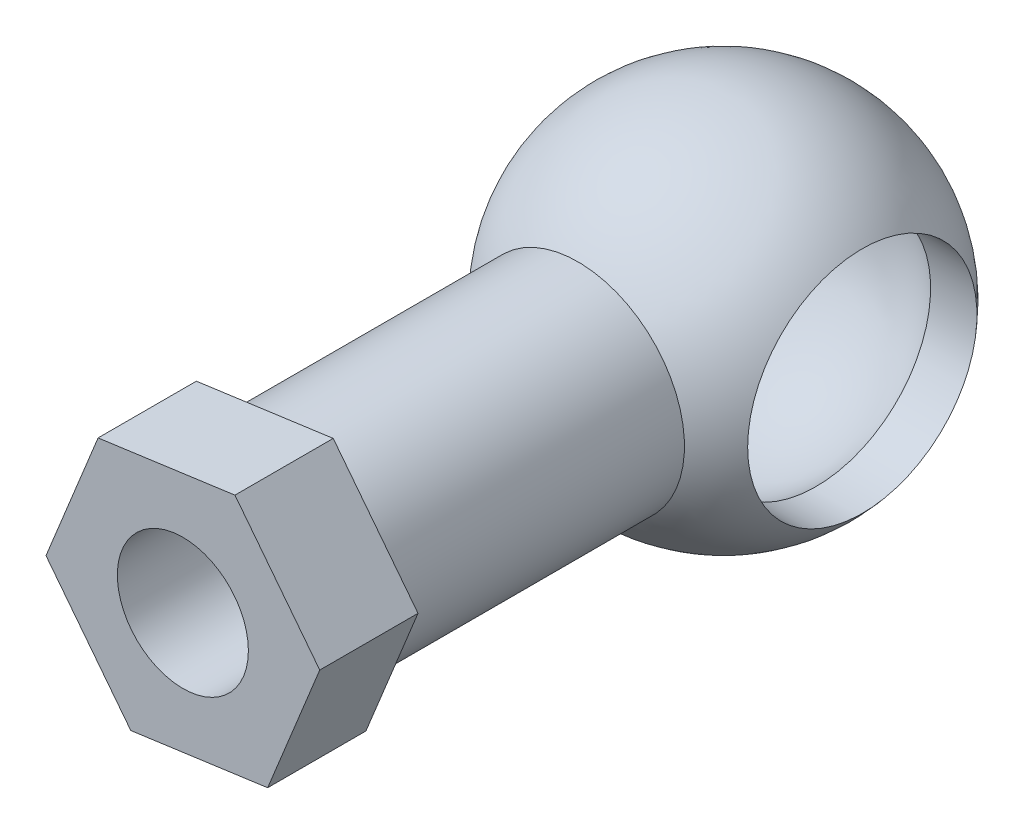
ISO-10303-21;
HEADER;
FILE_DESCRIPTION(('STEP AP214'),'2;1');
FILE_NAME('part.step','',(''),(''),'','','');
FILE_SCHEMA(('AUTOMOTIVE_DESIGN { 1 0 10303 214 1 1 1 1 }'));
ENDSEC;
DATA;
#1=APPLICATION_CONTEXT('core data for automotive mechanical design processes');
#2=APPLICATION_PROTOCOL_DEFINITION('international standard','automotive_design',2000,#1);
#3=PRODUCT_CONTEXT('',#1,'mechanical');
#4=PRODUCT('Part','Part','',(#3));
#5=PRODUCT_RELATED_PRODUCT_CATEGORY('part','',(#4));
#6=PRODUCT_DEFINITION_FORMATION('','',#4);
#7=PRODUCT_DEFINITION_CONTEXT('part definition',#1,'design');
#8=PRODUCT_DEFINITION('design','',#6,#7);
#9=PRODUCT_DEFINITION_SHAPE('','',#8);
#10=(LENGTH_UNIT() NAMED_UNIT(*) SI_UNIT(.MILLI.,.METRE.));
#11=(NAMED_UNIT(*) PLANE_ANGLE_UNIT() SI_UNIT($,.RADIAN.));
#12=(NAMED_UNIT(*) SI_UNIT($,.STERADIAN.) SOLID_ANGLE_UNIT());
#13=UNCERTAINTY_MEASURE_WITH_UNIT(LENGTH_MEASURE(1.E-05),#10,'distance_accuracy_value','');
#14=(GEOMETRIC_REPRESENTATION_CONTEXT(3) GLOBAL_UNCERTAINTY_ASSIGNED_CONTEXT((#13)) GLOBAL_UNIT_ASSIGNED_CONTEXT((#10,
#11,#12)) REPRESENTATION_CONTEXT('',''));
#15=CARTESIAN_POINT('',(0.,0.,0.));
#16=DIRECTION('',(0.,0.,1.));
#17=DIRECTION('',(1.,0.,0.));
#18=AXIS2_PLACEMENT_3D('',#15,#16,#17);
#19=CARTESIAN_POINT('',(0.,0.,0.));
#20=DIRECTION('',(0.,1.,0.));
#21=DIRECTION('',(-1.,0.,0.));
#22=AXIS2_PLACEMENT_3D('',#19,#20,#21);
#23=SPHERICAL_SURFACE('',#22,9.);
#24=CARTESIAN_POINT('',(0.,0.,0.));
#25=DIRECTION('',(-1.,0.,0.));
#26=DIRECTION('',(0.,0.,1.));
#27=AXIS2_PLACEMENT_3D('',#24,#25,#26);
#28=SPHERICAL_SURFACE('',#27,9.);
#29=CARTESIAN_POINT('',(5.65685424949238,0.,0.));
#30=DIRECTION('',(-1.,0.,0.));
#31=DIRECTION('',(0.,0.,1.));
#32=AXIS2_PLACEMENT_3D('',#29,#30,#31);
#33=CIRCLE('',#32,7.);
#34=CARTESIAN_POINT('',(5.65685424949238,0.,7.));
#35=VERTEX_POINT('',#34);
#36=EDGE_CURVE('E142',#35,#35,#33,.F.);
#37=ORIENTED_EDGE('',*,*,#36,.T.);
#38=EDGE_LOOP('',(#37));
#39=FACE_BOUND('',#38,.T.);
#40=ADVANCED_FACE('F33',(#39),#28,.F.);
#41=CARTESIAN_POINT('',(30.,0.,0.));
#42=DIRECTION('',(-1.,0.,0.));
#43=DIRECTION('',(0.,0.,1.));
#44=AXIS2_PLACEMENT_3D('',#41,#42,#43);
#45=CYLINDRICAL_SURFACE('',#44,7.);
#46=CARTESIAN_POINT('',(8.48528137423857,0.,0.));
#47=DIRECTION('',(-1.,0.,0.));
#48=DIRECTION('',(0.,0.,1.));
#49=AXIS2_PLACEMENT_3D('',#46,#47,#48);
#50=CIRCLE('',#49,7.);
#51=CARTESIAN_POINT('',(8.48528137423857,0.,7.));
#52=VERTEX_POINT('',#51);
#53=EDGE_CURVE('E143',#52,#52,#50,.T.);
#54=ORIENTED_EDGE('',*,*,#53,.F.);
#55=EDGE_LOOP('',(#54));
#56=FACE_BOUND('',#55,.T.);
#57=ORIENTED_EDGE('',*,*,#36,.F.);
#58=EDGE_LOOP('',(#57));
#59=FACE_BOUND('',#58,.T.);
#60=ADVANCED_FACE('F155',(#56,#59),#45,.F.);
#61=CARTESIAN_POINT('',(0.,0.,0.));
#62=DIRECTION('',(0.,1.,0.));
#63=DIRECTION('',(1.,0.,0.));
#64=AXIS2_PLACEMENT_3D('',#61,#62,#63);
#65=SPHERICAL_SURFACE('',#64,11.);
#66=CARTESIAN_POINT('',(0.,0.,8.87411967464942));
#67=DIRECTION('',(0.,0.,-1.));
#68=DIRECTION('',(-1.,0.,0.));
#69=AXIS2_PLACEMENT_3D('',#66,#67,#68);
#70=CIRCLE('',#69,6.5);
#71=CARTESIAN_POINT('',(-6.5,0.,8.87411967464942));
#72=VERTEX_POINT('',#71);
#73=EDGE_CURVE('E41',#72,#72,#70,.F.);
#74=ORIENTED_EDGE('',*,*,#73,.F.);
#75=EDGE_LOOP('',(#74));
#76=FACE_BOUND('',#75,.T.);
#77=ORIENTED_EDGE('',*,*,#53,.T.);
#78=EDGE_LOOP('',(#77));
#79=FACE_BOUND('',#78,.T.);
#80=ADVANCED_FACE('F152',(#76,#79),#65,.T.);
#81=CARTESIAN_POINT('',(0.,0.,0.));
#82=DIRECTION('',(0.,0.,-1.));
#83=DIRECTION('',(-1.,0.,0.));
#84=AXIS2_PLACEMENT_3D('',#81,#82,#83);
#85=CYLINDRICAL_SURFACE('',#84,6.5);
#86=CARTESIAN_POINT('',(0.,0.,27.));
#87=DIRECTION('',(0.,0.,1.));
#88=DIRECTION('',(1.,0.,0.));
#89=AXIS2_PLACEMENT_3D('',#86,#87,#88);
#90=CIRCLE('',#89,6.5);
#91=CARTESIAN_POINT('',(6.5,0.,27.));
#92=VERTEX_POINT('',#91);
#93=EDGE_CURVE('E139',#92,#92,#90,.F.);
#94=ORIENTED_EDGE('',*,*,#93,.T.);
#95=EDGE_LOOP('',(#94));
#96=FACE_BOUND('',#95,.T.);
#97=ORIENTED_EDGE('',*,*,#73,.T.);
#98=EDGE_LOOP('',(#97));
#99=FACE_BOUND('',#98,.T.);
#100=ADVANCED_FACE('F150',(#96,#99),#85,.T.);
#101=CARTESIAN_POINT('',(5.1770491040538,-6.66122630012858,33.));
#102=DIRECTION('',(0.,0.,1.));
#103=DIRECTION('',(1.,0.,0.));
#104=AXIS2_PLACEMENT_3D('',#101,#102,#103);
#105=PLANE('',#104);
#106=DIRECTION('',(0.990619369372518,0.136650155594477,0.));
#107=VECTOR('',#106,1.);
#108=CARTESIAN_POINT('',(-3.18026664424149,-7.81406919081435,33.));
#109=LINE('',#108,#107);
#110=CARTESIAN_POINT('',(-3.18026664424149,-7.81406919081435,33.));
#111=VERTEX_POINT('',#110);
#112=CARTESIAN_POINT('',(5.1770491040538,-6.66122630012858,33.));
#113=VERTEX_POINT('',#112);
#114=EDGE_CURVE('E130',#111,#113,#109,.T.);
#115=ORIENTED_EDGE('',*,*,#114,.T.);
#116=DIRECTION('',(0.376967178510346,0.926226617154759,0.));
#117=VECTOR('',#116,1.);
#118=CARTESIAN_POINT('',(5.1770491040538,-6.66122630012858,33.));
#119=LINE('',#118,#117);
#120=CARTESIAN_POINT('',(8.35731574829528,1.15284289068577,33.));
#121=VERTEX_POINT('',#120);
#122=EDGE_CURVE('E87',#113,#121,#119,.T.);
#123=ORIENTED_EDGE('',*,*,#122,.T.);
#124=DIRECTION('',(-0.613652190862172,0.789576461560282,0.));
#125=VECTOR('',#124,1.);
#126=CARTESIAN_POINT('',(8.35731574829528,1.15284289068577,33.));
#127=LINE('',#126,#125);
#128=CARTESIAN_POINT('',(3.18026664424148,7.81406919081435,33.));
#129=VERTEX_POINT('',#128);
#130=EDGE_CURVE('E101',#121,#129,#127,.T.);
#131=ORIENTED_EDGE('',*,*,#130,.T.);
#132=DIRECTION('',(-0.990619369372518,-0.136650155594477,0.));
#133=VECTOR('',#132,1.);
#134=CARTESIAN_POINT('',(3.18026664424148,7.81406919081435,33.));
#135=LINE('',#134,#133);
#136=CARTESIAN_POINT('',(-5.1770491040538,6.66122630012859,33.));
#137=VERTEX_POINT('',#136);
#138=EDGE_CURVE('E94',#129,#137,#135,.T.);
#139=ORIENTED_EDGE('',*,*,#138,.T.);
#140=DIRECTION('',(-0.376967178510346,-0.926226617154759,0.));
#141=VECTOR('',#140,1.);
#142=CARTESIAN_POINT('',(-5.1770491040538,6.66122630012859,33.));
#143=LINE('',#142,#141);
#144=CARTESIAN_POINT('',(-8.35731574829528,-1.15284289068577,33.));
#145=VERTEX_POINT('',#144);
#146=EDGE_CURVE('E99',#137,#145,#143,.T.);
#147=ORIENTED_EDGE('',*,*,#146,.T.);
#148=DIRECTION('',(0.613652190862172,-0.789576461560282,0.));
#149=VECTOR('',#148,1.);
#150=CARTESIAN_POINT('',(-8.35731574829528,-1.15284289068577,33.));
#151=LINE('',#150,#149);
#152=EDGE_CURVE('E49',#145,#111,#151,.T.);
#153=ORIENTED_EDGE('',*,*,#152,.T.);
#154=EDGE_LOOP('',(#115,#123,#131,#139,#147,#153));
#155=FACE_BOUND('',#154,.T.);
#156=CARTESIAN_POINT('',(0.,0.,33.));
#157=DIRECTION('',(0.,0.,1.));
#158=DIRECTION('',(1.,0.,0.));
#159=AXIS2_PLACEMENT_3D('',#156,#157,#158);
#160=CIRCLE('',#159,4.);
#161=CARTESIAN_POINT('',(4.,0.,33.));
#162=VERTEX_POINT('',#161);
#163=EDGE_CURVE('E123',#162,#162,#160,.T.);
#164=ORIENTED_EDGE('',*,*,#163,.F.);
#165=EDGE_LOOP('',(#164));
#166=FACE_BOUND('',#165,.T.);
#167=ADVANCED_FACE('F96',(#155,#166),#105,.T.);
#168=CARTESIAN_POINT('',(5.1770491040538,-6.66122630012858,27.));
#169=DIRECTION('',(0.,0.,1.));
#170=DIRECTION('',(1.,0.,0.));
#171=AXIS2_PLACEMENT_3D('',#168,#169,#170);
#172=PLANE('',#171);
#173=ORIENTED_EDGE('',*,*,#93,.F.);
#174=EDGE_LOOP('',(#173));
#175=FACE_BOUND('',#174,.T.);
#176=DIRECTION('',(0.990619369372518,0.136650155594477,0.));
#177=VECTOR('',#176,1.);
#178=CARTESIAN_POINT('',(-3.18026664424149,-7.81406919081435,27.));
#179=LINE('',#178,#177);
#180=CARTESIAN_POINT('',(-3.18026664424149,-7.81406919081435,27.));
#181=VERTEX_POINT('',#180);
#182=CARTESIAN_POINT('',(5.1770491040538,-6.66122630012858,27.));
#183=VERTEX_POINT('',#182);
#184=EDGE_CURVE('E119',#181,#183,#179,.T.);
#185=ORIENTED_EDGE('',*,*,#184,.F.);
#186=DIRECTION('',(0.613652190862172,-0.789576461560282,0.));
#187=VECTOR('',#186,1.);
#188=CARTESIAN_POINT('',(-8.35731574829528,-1.15284289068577,27.));
#189=LINE('',#188,#187);
#190=CARTESIAN_POINT('',(-8.35731574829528,-1.15284289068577,27.));
#191=VERTEX_POINT('',#190);
#192=EDGE_CURVE('E78',#191,#181,#189,.T.);
#193=ORIENTED_EDGE('',*,*,#192,.F.);
#194=DIRECTION('',(-0.376967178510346,-0.926226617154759,0.));
#195=VECTOR('',#194,1.);
#196=CARTESIAN_POINT('',(-5.1770491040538,6.66122630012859,27.));
#197=LINE('',#196,#195);
#198=CARTESIAN_POINT('',(-5.1770491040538,6.66122630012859,27.));
#199=VERTEX_POINT('',#198);
#200=EDGE_CURVE('E72',#199,#191,#197,.T.);
#201=ORIENTED_EDGE('',*,*,#200,.F.);
#202=DIRECTION('',(-0.990619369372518,-0.136650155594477,0.));
#203=VECTOR('',#202,1.);
#204=CARTESIAN_POINT('',(3.18026664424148,7.81406919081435,27.));
#205=LINE('',#204,#203);
#206=CARTESIAN_POINT('',(3.18026664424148,7.81406919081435,27.));
#207=VERTEX_POINT('',#206);
#208=EDGE_CURVE('E109',#207,#199,#205,.T.);
#209=ORIENTED_EDGE('',*,*,#208,.F.);
#210=DIRECTION('',(-0.613652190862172,0.789576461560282,0.));
#211=VECTOR('',#210,1.);
#212=CARTESIAN_POINT('',(8.35731574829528,1.15284289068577,27.));
#213=LINE('',#212,#211);
#214=CARTESIAN_POINT('',(8.35731574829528,1.15284289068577,27.));
#215=VERTEX_POINT('',#214);
#216=EDGE_CURVE('E125',#215,#207,#213,.T.);
#217=ORIENTED_EDGE('',*,*,#216,.F.);
#218=DIRECTION('',(0.376967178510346,0.926226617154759,0.));
#219=VECTOR('',#218,1.);
#220=CARTESIAN_POINT('',(5.1770491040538,-6.66122630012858,27.));
#221=LINE('',#220,#219);
#222=EDGE_CURVE('E122',#183,#215,#221,.T.);
#223=ORIENTED_EDGE('',*,*,#222,.F.);
#224=EDGE_LOOP('',(#185,#193,#201,#209,#217,#223));
#225=FACE_BOUND('',#224,.T.);
#226=ADVANCED_FACE('F187',(#175,#225),#172,.F.);
#227=CARTESIAN_POINT('',(-3.18026664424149,-7.81406919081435,33.));
#228=DIRECTION('',(-0.136650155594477,0.990619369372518,0.));
#229=DIRECTION('',(-0.990619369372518,-0.136650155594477,0.));
#230=AXIS2_PLACEMENT_3D('',#227,#228,#229);
#231=PLANE('',#230);
#232=ORIENTED_EDGE('',*,*,#184,.T.);
#233=DIRECTION('',(0.,0.,-1.));
#234=VECTOR('',#233,1.);
#235=CARTESIAN_POINT('',(5.1770491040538,-6.66122630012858,33.));
#236=LINE('',#235,#234);
#237=EDGE_CURVE('E137',#113,#183,#236,.T.);
#238=ORIENTED_EDGE('',*,*,#237,.F.);
#239=ORIENTED_EDGE('',*,*,#114,.F.);
#240=DIRECTION('',(0.,0.,-1.));
#241=VECTOR('',#240,1.);
#242=CARTESIAN_POINT('',(-3.18026664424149,-7.81406919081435,33.));
#243=LINE('',#242,#241);
#244=EDGE_CURVE('E115',#111,#181,#243,.T.);
#245=ORIENTED_EDGE('',*,*,#244,.T.);
#246=EDGE_LOOP('',(#232,#238,#239,#245));
#247=FACE_BOUND('',#246,.T.);
#248=ADVANCED_FACE('F194',(#247),#231,.F.);
#249=CARTESIAN_POINT('',(5.1770491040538,-6.66122630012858,33.));
#250=DIRECTION('',(-0.926226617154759,0.376967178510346,0.));
#251=DIRECTION('',(-0.376967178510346,-0.926226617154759,0.));
#252=AXIS2_PLACEMENT_3D('',#249,#250,#251);
#253=PLANE('',#252);
#254=ORIENTED_EDGE('',*,*,#222,.T.);
#255=DIRECTION('',(0.,0.,-1.));
#256=VECTOR('',#255,1.);
#257=CARTESIAN_POINT('',(8.35731574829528,1.15284289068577,33.));
#258=LINE('',#257,#256);
#259=EDGE_CURVE('E134',#121,#215,#258,.T.);
#260=ORIENTED_EDGE('',*,*,#259,.F.);
#261=ORIENTED_EDGE('',*,*,#122,.F.);
#262=ORIENTED_EDGE('',*,*,#237,.T.);
#263=EDGE_LOOP('',(#254,#260,#261,#262));
#264=FACE_BOUND('',#263,.T.);
#265=ADVANCED_FACE('F202',(#264),#253,.F.);
#266=CARTESIAN_POINT('',(8.35731574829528,1.15284289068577,33.));
#267=DIRECTION('',(-0.789576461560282,-0.613652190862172,0.));
#268=DIRECTION('',(0.613652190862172,-0.789576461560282,0.));
#269=AXIS2_PLACEMENT_3D('',#266,#267,#268);
#270=PLANE('',#269);
#271=ORIENTED_EDGE('',*,*,#216,.T.);
#272=DIRECTION('',(0.,0.,-1.));
#273=VECTOR('',#272,1.);
#274=CARTESIAN_POINT('',(3.18026664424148,7.81406919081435,33.));
#275=LINE('',#274,#273);
#276=EDGE_CURVE('E110',#129,#207,#275,.T.);
#277=ORIENTED_EDGE('',*,*,#276,.F.);
#278=ORIENTED_EDGE('',*,*,#130,.F.);
#279=ORIENTED_EDGE('',*,*,#259,.T.);
#280=EDGE_LOOP('',(#271,#277,#278,#279));
#281=FACE_BOUND('',#280,.T.);
#282=ADVANCED_FACE('F210',(#281),#270,.F.);
#283=CARTESIAN_POINT('',(3.18026664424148,7.81406919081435,33.));
#284=DIRECTION('',(0.136650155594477,-0.990619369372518,0.));
#285=DIRECTION('',(0.990619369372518,0.136650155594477,0.));
#286=AXIS2_PLACEMENT_3D('',#283,#284,#285);
#287=PLANE('',#286);
#288=ORIENTED_EDGE('',*,*,#208,.T.);
#289=DIRECTION('',(0.,0.,-1.));
#290=VECTOR('',#289,1.);
#291=CARTESIAN_POINT('',(-5.1770491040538,6.66122630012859,33.));
#292=LINE('',#291,#290);
#293=EDGE_CURVE('E106',#137,#199,#292,.T.);
#294=ORIENTED_EDGE('',*,*,#293,.F.);
#295=ORIENTED_EDGE('',*,*,#138,.F.);
#296=ORIENTED_EDGE('',*,*,#276,.T.);
#297=EDGE_LOOP('',(#288,#294,#295,#296));
#298=FACE_BOUND('',#297,.T.);
#299=ADVANCED_FACE('F107',(#298),#287,.F.);
#300=CARTESIAN_POINT('',(-5.1770491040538,6.66122630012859,33.));
#301=DIRECTION('',(0.926226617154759,-0.376967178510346,0.));
#302=DIRECTION('',(0.376967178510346,0.92622661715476,0.));
#303=AXIS2_PLACEMENT_3D('',#300,#301,#302);
#304=PLANE('',#303);
#305=ORIENTED_EDGE('',*,*,#200,.T.);
#306=DIRECTION('',(0.,0.,-1.));
#307=VECTOR('',#306,1.);
#308=CARTESIAN_POINT('',(-8.35731574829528,-1.15284289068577,33.));
#309=LINE('',#308,#307);
#310=EDGE_CURVE('E111',#145,#191,#309,.T.);
#311=ORIENTED_EDGE('',*,*,#310,.F.);
#312=ORIENTED_EDGE('',*,*,#146,.F.);
#313=ORIENTED_EDGE('',*,*,#293,.T.);
#314=EDGE_LOOP('',(#305,#311,#312,#313));
#315=FACE_BOUND('',#314,.T.);
#316=ADVANCED_FACE('F113',(#315),#304,.F.);
#317=CARTESIAN_POINT('',(-8.35731574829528,-1.15284289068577,33.));
#318=DIRECTION('',(0.789576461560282,0.613652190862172,0.));
#319=DIRECTION('',(-0.613652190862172,0.789576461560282,0.));
#320=AXIS2_PLACEMENT_3D('',#317,#318,#319);
#321=PLANE('',#320);
#322=ORIENTED_EDGE('',*,*,#192,.T.);
#323=ORIENTED_EDGE('',*,*,#244,.F.);
#324=ORIENTED_EDGE('',*,*,#152,.F.);
#325=ORIENTED_EDGE('',*,*,#310,.T.);
#326=EDGE_LOOP('',(#322,#323,#324,#325));
#327=FACE_BOUND('',#326,.T.);
#328=ADVANCED_FACE('F230',(#327),#321,.F.);
#329=CARTESIAN_POINT('',(0.,0.,33.));
#330=DIRECTION('',(0.,0.,-1.));
#331=DIRECTION('',(-1.,0.,0.));
#332=AXIS2_PLACEMENT_3D('',#329,#330,#331);
#333=CYLINDRICAL_SURFACE('',#332,4.);
#334=ORIENTED_EDGE('',*,*,#163,.T.);
#335=EDGE_LOOP('',(#334));
#336=FACE_BOUND('',#335,.T.);
#337=CARTESIAN_POINT('',(0.,0.,27.));
#338=DIRECTION('',(0.,0.,1.));
#339=DIRECTION('',(1.,0.,0.));
#340=AXIS2_PLACEMENT_3D('',#337,#338,#339);
#341=CIRCLE('',#340,4.);
#342=CARTESIAN_POINT('',(4.,0.,27.));
#343=VERTEX_POINT('',#342);
#344=EDGE_CURVE('E11',#343,#343,#341,.F.);
#345=ORIENTED_EDGE('',*,*,#344,.T.);
#346=EDGE_LOOP('',(#345));
#347=FACE_BOUND('',#346,.T.);
#348=ADVANCED_FACE('F237',(#336,#347),#333,.F.);
#349=CARTESIAN_POINT('',(-6.5,0.,27.));
#350=DIRECTION('',(0.,0.,1.));
#351=DIRECTION('',(1.,0.,0.));
#352=AXIS2_PLACEMENT_3D('',#349,#350,#351);
#353=PLANE('',#352);
#354=ORIENTED_EDGE('',*,*,#344,.F.);
#355=EDGE_LOOP('',(#354));
#356=FACE_BOUND('',#355,.T.);
#357=ADVANCED_FACE('F244',(#356),#353,.T.);
#358=CLOSED_SHELL('',(#40,#60,#80,#100,#167,#226,#248,#265,#282,#299,#316,#328,#348,#357));
#359=MANIFOLD_SOLID_BREP('B2',#358);
#360=ADVANCED_BREP_SHAPE_REPRESENTATION('',(#18,#359),#14);
#361=SHAPE_DEFINITION_REPRESENTATION(#9,#360);
ENDSEC;
END-ISO-10303-21;
